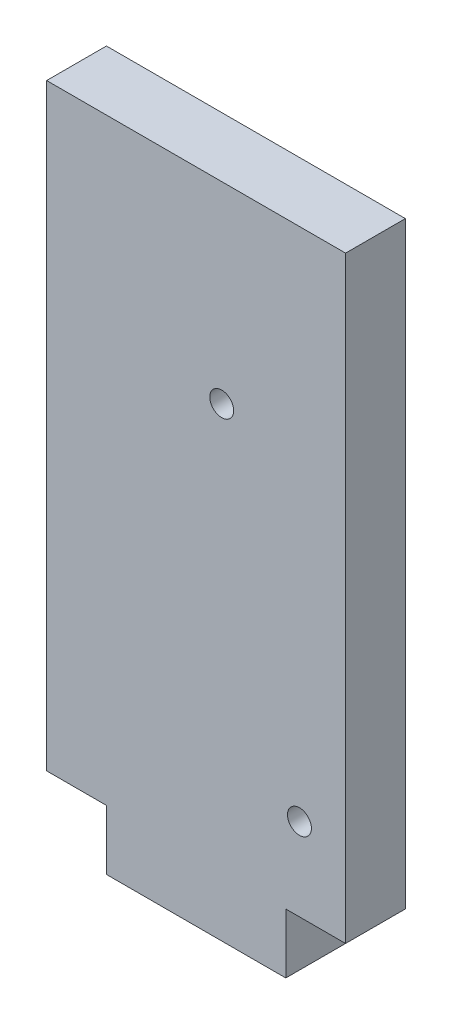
ISO-10303-21;
HEADER;
FILE_DESCRIPTION(('STEP AP214'),'2;1');
FILE_NAME('part.step','',(''),(''),'','','');
FILE_SCHEMA(('AUTOMOTIVE_DESIGN { 1 0 10303 214 1 1 1 1 }'));
ENDSEC;
DATA;
#1=APPLICATION_CONTEXT('core data for automotive mechanical design processes');
#2=APPLICATION_PROTOCOL_DEFINITION('international standard','automotive_design',2000,#1);
#3=PRODUCT_CONTEXT('',#1,'mechanical');
#4=PRODUCT('Part','Part','',(#3));
#5=PRODUCT_RELATED_PRODUCT_CATEGORY('part','',(#4));
#6=PRODUCT_DEFINITION_FORMATION('','',#4);
#7=PRODUCT_DEFINITION_CONTEXT('part definition',#1,'design');
#8=PRODUCT_DEFINITION('design','',#6,#7);
#9=PRODUCT_DEFINITION_SHAPE('','',#8);
#10=(LENGTH_UNIT() NAMED_UNIT(*) SI_UNIT(.MILLI.,.METRE.));
#11=(NAMED_UNIT(*) PLANE_ANGLE_UNIT() SI_UNIT($,.RADIAN.));
#12=(NAMED_UNIT(*) SI_UNIT($,.STERADIAN.) SOLID_ANGLE_UNIT());
#13=UNCERTAINTY_MEASURE_WITH_UNIT(LENGTH_MEASURE(1.E-05),#10,'distance_accuracy_value','');
#14=(GEOMETRIC_REPRESENTATION_CONTEXT(3) GLOBAL_UNCERTAINTY_ASSIGNED_CONTEXT((#13)) GLOBAL_UNIT_ASSIGNED_CONTEXT((#10,
#11,#12)) REPRESENTATION_CONTEXT('',''));
#15=CARTESIAN_POINT('',(0.,0.,0.));
#16=DIRECTION('',(0.,0.,1.));
#17=DIRECTION('',(1.,0.,0.));
#18=AXIS2_PLACEMENT_3D('',#15,#16,#17);
#19=CARTESIAN_POINT('',(7.5,5.,2.5));
#20=DIRECTION('',(-1.,0.,0.));
#21=DIRECTION('',(0.,0.,1.));
#22=AXIS2_PLACEMENT_3D('',#19,#20,#21);
#23=PLANE('',#22);
#24=DIRECTION('',(0.,0.,-1.));
#25=VECTOR('',#24,1.);
#26=CARTESIAN_POINT('',(7.5,0.,2.5));
#27=LINE('',#26,#25);
#28=CARTESIAN_POINT('',(7.5,0.,2.5));
#29=VERTEX_POINT('',#28);
#30=CARTESIAN_POINT('',(7.5,0.,-2.5));
#31=VERTEX_POINT('',#30);
#32=EDGE_CURVE('E133',#29,#31,#27,.T.);
#33=ORIENTED_EDGE('',*,*,#32,.T.);
#34=DIRECTION('',(0.,-1.,0.));
#35=VECTOR('',#34,1.);
#36=CARTESIAN_POINT('',(7.5,5.,-2.5));
#37=LINE('',#36,#35);
#38=CARTESIAN_POINT('',(7.5,5.,-2.5));
#39=VERTEX_POINT('',#38);
#40=EDGE_CURVE('E11',#39,#31,#37,.T.);
#41=ORIENTED_EDGE('',*,*,#40,.F.);
#42=DIRECTION('',(0.,0.,-1.));
#43=VECTOR('',#42,1.);
#44=CARTESIAN_POINT('',(7.5,5.,2.5));
#45=LINE('',#44,#43);
#46=CARTESIAN_POINT('',(7.5,5.,2.5));
#47=VERTEX_POINT('',#46);
#48=EDGE_CURVE('E141',#47,#39,#45,.T.);
#49=ORIENTED_EDGE('',*,*,#48,.F.);
#50=DIRECTION('',(0.,-1.,0.));
#51=VECTOR('',#50,1.);
#52=CARTESIAN_POINT('',(7.5,5.,2.5));
#53=LINE('',#52,#51);
#54=EDGE_CURVE('E53',#47,#29,#53,.T.);
#55=ORIENTED_EDGE('',*,*,#54,.T.);
#56=EDGE_LOOP('',(#33,#41,#49,#55));
#57=FACE_BOUND('',#56,.T.);
#58=ADVANCED_FACE('F37',(#57),#23,.F.);
#59=CARTESIAN_POINT('',(-7.5,5.,-2.5));
#60=DIRECTION('',(0.,0.,1.));
#61=DIRECTION('',(1.,0.,0.));
#62=AXIS2_PLACEMENT_3D('',#59,#60,#61);
#63=PLANE('',#62);
#64=CARTESIAN_POINT('',(8.64288050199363,11.9035292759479,-2.5));
#65=DIRECTION('',(0.,0.,1.));
#66=DIRECTION('',(1.,0.,0.));
#67=AXIS2_PLACEMENT_3D('',#64,#65,#66);
#68=CIRCLE('',#67,1.);
#69=CARTESIAN_POINT('',(9.64288050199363,11.9035292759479,-2.5));
#70=VERTEX_POINT('',#69);
#71=EDGE_CURVE('E178',#70,#70,#68,.T.);
#72=ORIENTED_EDGE('',*,*,#71,.T.);
#73=EDGE_LOOP('',(#72));
#74=FACE_BOUND('',#73,.T.);
#75=CARTESIAN_POINT('',(2.14288050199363,38.9035292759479,-2.5));
#76=DIRECTION('',(0.,0.,1.));
#77=DIRECTION('',(1.,0.,0.));
#78=AXIS2_PLACEMENT_3D('',#75,#76,#77);
#79=CIRCLE('',#78,1.);
#80=CARTESIAN_POINT('',(3.14288050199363,38.9035292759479,-2.5));
#81=VERTEX_POINT('',#80);
#82=EDGE_CURVE('E185',#81,#81,#79,.T.);
#83=ORIENTED_EDGE('',*,*,#82,.T.);
#84=EDGE_LOOP('',(#83));
#85=FACE_BOUND('',#84,.T.);
#86=DIRECTION('',(-1.,0.,0.));
#87=VECTOR('',#86,1.);
#88=CARTESIAN_POINT('',(-7.5,0.,-2.5));
#89=LINE('',#88,#87);
#90=CARTESIAN_POINT('',(-7.5,0.,-2.5));
#91=VERTEX_POINT('',#90);
#92=EDGE_CURVE('E135',#31,#91,#89,.T.);
#93=ORIENTED_EDGE('',*,*,#92,.T.);
#94=DIRECTION('',(0.,-1.,0.));
#95=VECTOR('',#94,1.);
#96=CARTESIAN_POINT('',(-7.5,5.,-2.5));
#97=LINE('',#96,#95);
#98=CARTESIAN_POINT('',(-7.5,5.,-2.5));
#99=VERTEX_POINT('',#98);
#100=EDGE_CURVE('E45',#99,#91,#97,.T.);
#101=ORIENTED_EDGE('',*,*,#100,.F.);
#102=DIRECTION('',(-1.,0.,0.));
#103=VECTOR('',#102,1.);
#104=CARTESIAN_POINT('',(-12.5,5.,-2.5));
#105=LINE('',#104,#103);
#106=CARTESIAN_POINT('',(-12.5,5.,-2.5));
#107=VERTEX_POINT('',#106);
#108=EDGE_CURVE('E177',#99,#107,#105,.T.);
#109=ORIENTED_EDGE('',*,*,#108,.T.);
#110=DIRECTION('',(0.,-1.,0.));
#111=VECTOR('',#110,1.);
#112=CARTESIAN_POINT('',(-12.5,55.,-2.5));
#113=LINE('',#112,#111);
#114=CARTESIAN_POINT('',(-12.5,55.,-2.5));
#115=VERTEX_POINT('',#114);
#116=EDGE_CURVE('E115',#115,#107,#113,.T.);
#117=ORIENTED_EDGE('',*,*,#116,.F.);
#118=DIRECTION('',(-1.,0.,0.));
#119=VECTOR('',#118,1.);
#120=CARTESIAN_POINT('',(-12.5,55.,-2.5));
#121=LINE('',#120,#119);
#122=CARTESIAN_POINT('',(12.5,55.,-2.5));
#123=VERTEX_POINT('',#122);
#124=EDGE_CURVE('E107',#123,#115,#121,.T.);
#125=ORIENTED_EDGE('',*,*,#124,.F.);
#126=DIRECTION('',(0.,-1.,0.));
#127=VECTOR('',#126,1.);
#128=CARTESIAN_POINT('',(12.5,55.,-2.5));
#129=LINE('',#128,#127);
#130=CARTESIAN_POINT('',(12.5,5.,-2.5));
#131=VERTEX_POINT('',#130);
#132=EDGE_CURVE('E112',#123,#131,#129,.T.);
#133=ORIENTED_EDGE('',*,*,#132,.T.);
#134=EDGE_CURVE('E164',#131,#39,#105,.T.);
#135=ORIENTED_EDGE('',*,*,#134,.T.);
#136=ORIENTED_EDGE('',*,*,#40,.T.);
#137=EDGE_LOOP('',(#93,#101,#109,#117,#125,#133,#135,#136));
#138=FACE_BOUND('',#137,.T.);
#139=ADVANCED_FACE('F109',(#74,#85,#138),#63,.F.);
#140=CARTESIAN_POINT('',(-7.5,5.,2.5));
#141=DIRECTION('',(1.,0.,0.));
#142=DIRECTION('',(0.,0.,-1.));
#143=AXIS2_PLACEMENT_3D('',#140,#141,#142);
#144=PLANE('',#143);
#145=DIRECTION('',(0.,0.,1.));
#146=VECTOR('',#145,1.);
#147=CARTESIAN_POINT('',(-7.5,0.,2.5));
#148=LINE('',#147,#146);
#149=CARTESIAN_POINT('',(-7.5,0.,2.5));
#150=VERTEX_POINT('',#149);
#151=EDGE_CURVE('E72',#91,#150,#148,.T.);
#152=ORIENTED_EDGE('',*,*,#151,.T.);
#153=DIRECTION('',(0.,-1.,0.));
#154=VECTOR('',#153,1.);
#155=CARTESIAN_POINT('',(-7.5,5.,2.5));
#156=LINE('',#155,#154);
#157=CARTESIAN_POINT('',(-7.5,5.,2.5));
#158=VERTEX_POINT('',#157);
#159=EDGE_CURVE('E150',#158,#150,#156,.T.);
#160=ORIENTED_EDGE('',*,*,#159,.F.);
#161=DIRECTION('',(0.,0.,1.));
#162=VECTOR('',#161,1.);
#163=CARTESIAN_POINT('',(-7.5,5.,2.5));
#164=LINE('',#163,#162);
#165=EDGE_CURVE('E143',#99,#158,#164,.T.);
#166=ORIENTED_EDGE('',*,*,#165,.F.);
#167=ORIENTED_EDGE('',*,*,#100,.T.);
#168=EDGE_LOOP('',(#152,#160,#166,#167));
#169=FACE_BOUND('',#168,.T.);
#170=ADVANCED_FACE('F152',(#169),#144,.F.);
#171=CARTESIAN_POINT('',(-7.5,5.,2.5));
#172=DIRECTION('',(0.,0.,-1.));
#173=DIRECTION('',(-1.,0.,0.));
#174=AXIS2_PLACEMENT_3D('',#171,#172,#173);
#175=PLANE('',#174);
#176=CARTESIAN_POINT('',(8.64288050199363,11.9035292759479,2.5));
#177=DIRECTION('',(0.,0.,1.));
#178=DIRECTION('',(1.,0.,0.));
#179=AXIS2_PLACEMENT_3D('',#176,#177,#178);
#180=CIRCLE('',#179,1.);
#181=CARTESIAN_POINT('',(9.64288050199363,11.9035292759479,2.5));
#182=VERTEX_POINT('',#181);
#183=EDGE_CURVE('E188',#182,#182,#180,.T.);
#184=ORIENTED_EDGE('',*,*,#183,.F.);
#185=EDGE_LOOP('',(#184));
#186=FACE_BOUND('',#185,.T.);
#187=CARTESIAN_POINT('',(2.14288050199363,38.9035292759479,2.5));
#188=DIRECTION('',(0.,0.,1.));
#189=DIRECTION('',(1.,0.,0.));
#190=AXIS2_PLACEMENT_3D('',#187,#188,#189);
#191=CIRCLE('',#190,1.);
#192=CARTESIAN_POINT('',(3.14288050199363,38.9035292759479,2.5));
#193=VERTEX_POINT('',#192);
#194=EDGE_CURVE('E189',#193,#193,#191,.T.);
#195=ORIENTED_EDGE('',*,*,#194,.F.);
#196=EDGE_LOOP('',(#195));
#197=FACE_BOUND('',#196,.T.);
#198=DIRECTION('',(1.,0.,0.));
#199=VECTOR('',#198,1.);
#200=CARTESIAN_POINT('',(-7.5,0.,2.5));
#201=LINE('',#200,#199);
#202=EDGE_CURVE('E75',#150,#29,#201,.T.);
#203=ORIENTED_EDGE('',*,*,#202,.T.);
#204=ORIENTED_EDGE('',*,*,#54,.F.);
#205=DIRECTION('',(1.,0.,0.));
#206=VECTOR('',#205,1.);
#207=CARTESIAN_POINT('',(-12.5,5.,2.5));
#208=LINE('',#207,#206);
#209=CARTESIAN_POINT('',(12.5,5.,2.5));
#210=VERTEX_POINT('',#209);
#211=EDGE_CURVE('E159',#47,#210,#208,.T.);
#212=ORIENTED_EDGE('',*,*,#211,.T.);
#213=DIRECTION('',(0.,-1.,0.));
#214=VECTOR('',#213,1.);
#215=CARTESIAN_POINT('',(12.5,55.,2.5));
#216=LINE('',#215,#214);
#217=CARTESIAN_POINT('',(12.5,55.,2.5));
#218=VERTEX_POINT('',#217);
#219=EDGE_CURVE('E168',#218,#210,#216,.T.);
#220=ORIENTED_EDGE('',*,*,#219,.F.);
#221=DIRECTION('',(1.,0.,0.));
#222=VECTOR('',#221,1.);
#223=CARTESIAN_POINT('',(-12.5,55.,2.5));
#224=LINE('',#223,#222);
#225=CARTESIAN_POINT('',(-12.5,55.,2.5));
#226=VERTEX_POINT('',#225);
#227=EDGE_CURVE('E124',#226,#218,#224,.T.);
#228=ORIENTED_EDGE('',*,*,#227,.F.);
#229=DIRECTION('',(0.,-1.,0.));
#230=VECTOR('',#229,1.);
#231=CARTESIAN_POINT('',(-12.5,55.,2.5));
#232=LINE('',#231,#230);
#233=CARTESIAN_POINT('',(-12.5,5.,2.5));
#234=VERTEX_POINT('',#233);
#235=EDGE_CURVE('E137',#226,#234,#232,.T.);
#236=ORIENTED_EDGE('',*,*,#235,.T.);
#237=EDGE_CURVE('E128',#234,#158,#208,.T.);
#238=ORIENTED_EDGE('',*,*,#237,.T.);
#239=ORIENTED_EDGE('',*,*,#159,.T.);
#240=EDGE_LOOP('',(#203,#204,#212,#220,#228,#236,#238,#239));
#241=FACE_BOUND('',#240,.T.);
#242=ADVANCED_FACE('F172',(#186,#197,#241),#175,.F.);
#243=CARTESIAN_POINT('',(0.,0.,0.));
#244=DIRECTION('',(0.,-1.,0.));
#245=DIRECTION('',(0.,0.,-1.));
#246=AXIS2_PLACEMENT_3D('',#243,#244,#245);
#247=PLANE('',#246);
#248=ORIENTED_EDGE('',*,*,#32,.F.);
#249=ORIENTED_EDGE('',*,*,#202,.F.);
#250=ORIENTED_EDGE('',*,*,#151,.F.);
#251=ORIENTED_EDGE('',*,*,#92,.F.);
#252=EDGE_LOOP('',(#248,#249,#250,#251));
#253=FACE_BOUND('',#252,.T.);
#254=ADVANCED_FACE('F156',(#253),#247,.T.);
#255=CARTESIAN_POINT('',(0.,5.,0.));
#256=DIRECTION('',(0.,-1.,0.));
#257=DIRECTION('',(0.,0.,-1.));
#258=AXIS2_PLACEMENT_3D('',#255,#256,#257);
#259=PLANE('',#258);
#260=ORIENTED_EDGE('',*,*,#211,.F.);
#261=ORIENTED_EDGE('',*,*,#48,.T.);
#262=ORIENTED_EDGE('',*,*,#134,.F.);
#263=DIRECTION('',(0.,0.,-1.));
#264=VECTOR('',#263,1.);
#265=CARTESIAN_POINT('',(12.5,5.,2.5));
#266=LINE('',#265,#264);
#267=EDGE_CURVE('E132',#210,#131,#266,.T.);
#268=ORIENTED_EDGE('',*,*,#267,.F.);
#269=EDGE_LOOP('',(#260,#261,#262,#268));
#270=FACE_BOUND('',#269,.T.);
#271=ADVANCED_FACE('F160',(#270),#259,.T.);
#272=CARTESIAN_POINT('',(12.5,55.,2.5));
#273=DIRECTION('',(-1.,0.,0.));
#274=DIRECTION('',(0.,0.,1.));
#275=AXIS2_PLACEMENT_3D('',#272,#273,#274);
#276=PLANE('',#275);
#277=ORIENTED_EDGE('',*,*,#267,.T.);
#278=ORIENTED_EDGE('',*,*,#132,.F.);
#279=DIRECTION('',(0.,0.,-1.));
#280=VECTOR('',#279,1.);
#281=CARTESIAN_POINT('',(12.5,55.,2.5));
#282=LINE('',#281,#280);
#283=EDGE_CURVE('E119',#218,#123,#282,.T.);
#284=ORIENTED_EDGE('',*,*,#283,.F.);
#285=ORIENTED_EDGE('',*,*,#219,.T.);
#286=EDGE_LOOP('',(#277,#278,#284,#285));
#287=FACE_BOUND('',#286,.T.);
#288=ADVANCED_FACE('F130',(#287),#276,.F.);
#289=CARTESIAN_POINT('',(-12.5,55.,2.5));
#290=DIRECTION('',(1.,0.,0.));
#291=DIRECTION('',(0.,0.,-1.));
#292=AXIS2_PLACEMENT_3D('',#289,#290,#291);
#293=PLANE('',#292);
#294=DIRECTION('',(0.,0.,1.));
#295=VECTOR('',#294,1.);
#296=CARTESIAN_POINT('',(-12.5,5.,2.5));
#297=LINE('',#296,#295);
#298=EDGE_CURVE('E161',#107,#234,#297,.T.);
#299=ORIENTED_EDGE('',*,*,#298,.T.);
#300=ORIENTED_EDGE('',*,*,#235,.F.);
#301=DIRECTION('',(0.,0.,1.));
#302=VECTOR('',#301,1.);
#303=CARTESIAN_POINT('',(-12.5,55.,2.5));
#304=LINE('',#303,#302);
#305=EDGE_CURVE('E118',#115,#226,#304,.T.);
#306=ORIENTED_EDGE('',*,*,#305,.F.);
#307=ORIENTED_EDGE('',*,*,#116,.T.);
#308=EDGE_LOOP('',(#299,#300,#306,#307));
#309=FACE_BOUND('',#308,.T.);
#310=ADVANCED_FACE('F221',(#309),#293,.F.);
#311=CARTESIAN_POINT('',(0.,55.,0.));
#312=DIRECTION('',(0.,-1.,0.));
#313=DIRECTION('',(0.,0.,-1.));
#314=AXIS2_PLACEMENT_3D('',#311,#312,#313);
#315=PLANE('',#314);
#316=ORIENTED_EDGE('',*,*,#283,.T.);
#317=ORIENTED_EDGE('',*,*,#124,.T.);
#318=ORIENTED_EDGE('',*,*,#305,.T.);
#319=ORIENTED_EDGE('',*,*,#227,.T.);
#320=EDGE_LOOP('',(#316,#317,#318,#319));
#321=FACE_BOUND('',#320,.T.);
#322=ADVANCED_FACE('F122',(#321),#315,.F.);
#323=ORIENTED_EDGE('',*,*,#108,.F.);
#324=ORIENTED_EDGE('',*,*,#165,.T.);
#325=ORIENTED_EDGE('',*,*,#237,.F.);
#326=ORIENTED_EDGE('',*,*,#298,.F.);
#327=EDGE_LOOP('',(#323,#324,#325,#326));
#328=FACE_BOUND('',#327,.T.);
#329=ADVANCED_FACE('F176',(#328),#259,.T.);
#330=CARTESIAN_POINT('',(2.14288050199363,38.9035292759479,-47.5));
#331=DIRECTION('',(0.,0.,1.));
#332=DIRECTION('',(1.,0.,0.));
#333=AXIS2_PLACEMENT_3D('',#330,#331,#332);
#334=CYLINDRICAL_SURFACE('',#333,1.);
#335=ORIENTED_EDGE('',*,*,#194,.T.);
#336=EDGE_LOOP('',(#335));
#337=FACE_BOUND('',#336,.T.);
#338=ORIENTED_EDGE('',*,*,#82,.F.);
#339=EDGE_LOOP('',(#338));
#340=FACE_BOUND('',#339,.T.);
#341=ADVANCED_FACE('F203',(#337,#340),#334,.F.);
#342=CARTESIAN_POINT('',(8.64288050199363,11.9035292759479,-47.5));
#343=DIRECTION('',(0.,0.,1.));
#344=DIRECTION('',(1.,0.,0.));
#345=AXIS2_PLACEMENT_3D('',#342,#343,#344);
#346=CYLINDRICAL_SURFACE('',#345,1.);
#347=ORIENTED_EDGE('',*,*,#183,.T.);
#348=EDGE_LOOP('',(#347));
#349=FACE_BOUND('',#348,.T.);
#350=ORIENTED_EDGE('',*,*,#71,.F.);
#351=EDGE_LOOP('',(#350));
#352=FACE_BOUND('',#351,.T.);
#353=ADVANCED_FACE('F195',(#349,#352),#346,.F.);
#354=CLOSED_SHELL('',(#58,#139,#170,#242,#254,#271,#288,#310,#322,#329,#341,#353));
#355=MANIFOLD_SOLID_BREP('B2',#354);
#356=ADVANCED_BREP_SHAPE_REPRESENTATION('',(#18,#355),#14);
#357=SHAPE_DEFINITION_REPRESENTATION(#9,#356);
ENDSEC;
END-ISO-10303-21;
